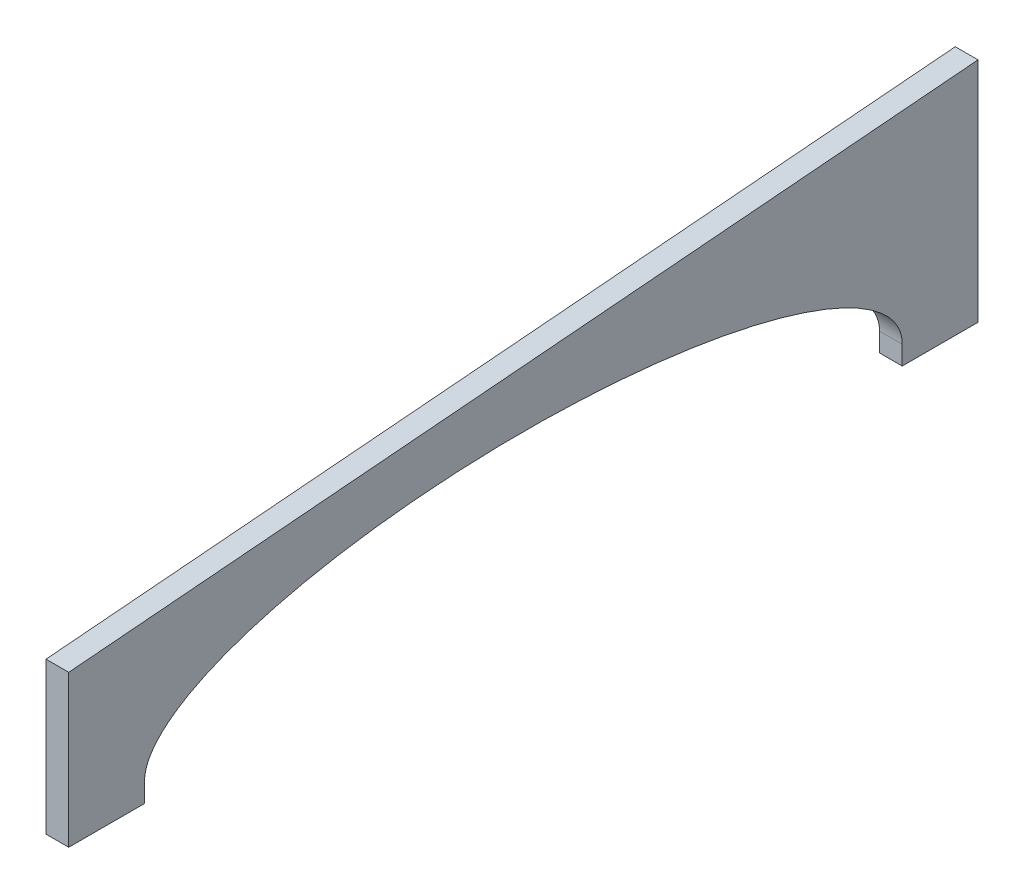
ISO-10303-21;
HEADER;
FILE_DESCRIPTION(('STEP AP214'),'2;1');
FILE_NAME('part.step','',(''),(''),'','','');
FILE_SCHEMA(('AUTOMOTIVE_DESIGN { 1 0 10303 214 1 1 1 1 }'));
ENDSEC;
DATA;
#1=APPLICATION_CONTEXT('core data for automotive mechanical design processes');
#2=APPLICATION_PROTOCOL_DEFINITION('international standard','automotive_design',2000,#1);
#3=PRODUCT_CONTEXT('',#1,'mechanical');
#4=PRODUCT('Part','Part','',(#3));
#5=PRODUCT_RELATED_PRODUCT_CATEGORY('part','',(#4));
#6=PRODUCT_DEFINITION_FORMATION('','',#4);
#7=PRODUCT_DEFINITION_CONTEXT('part definition',#1,'design');
#8=PRODUCT_DEFINITION('design','',#6,#7);
#9=PRODUCT_DEFINITION_SHAPE('','',#8);
#10=(LENGTH_UNIT() NAMED_UNIT(*) SI_UNIT(.MILLI.,.METRE.));
#11=(NAMED_UNIT(*) PLANE_ANGLE_UNIT() SI_UNIT($,.RADIAN.));
#12=(NAMED_UNIT(*) SI_UNIT($,.STERADIAN.) SOLID_ANGLE_UNIT());
#13=UNCERTAINTY_MEASURE_WITH_UNIT(LENGTH_MEASURE(1.E-05),#10,'distance_accuracy_value','');
#14=(GEOMETRIC_REPRESENTATION_CONTEXT(3) GLOBAL_UNCERTAINTY_ASSIGNED_CONTEXT((#13)) GLOBAL_UNIT_ASSIGNED_CONTEXT((#10,
#11,#12)) REPRESENTATION_CONTEXT('',''));
#15=CARTESIAN_POINT('',(0.,0.,0.));
#16=DIRECTION('',(0.,0.,1.));
#17=DIRECTION('',(1.,0.,0.));
#18=AXIS2_PLACEMENT_3D('',#15,#16,#17);
#19=CARTESIAN_POINT('',(6.,40.,0.));
#20=DIRECTION('',(0.,-0.996545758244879,-0.0830454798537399));
#21=DIRECTION('',(0.,0.0830454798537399,-0.99654575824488));
#22=AXIS2_PLACEMENT_3D('',#19,#20,#21);
#23=PLANE('',#22);
#24=DIRECTION('',(0.,-0.0830454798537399,0.99654575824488));
#25=VECTOR('',#24,1.);
#26=CARTESIAN_POINT('',(0.,40.,0.));
#27=LINE('',#26,#25);
#28=CARTESIAN_POINT('',(0.,60.,-240.));
#29=VERTEX_POINT('',#28);
#30=CARTESIAN_POINT('',(0.,40.,0.));
#31=VERTEX_POINT('',#30);
#32=EDGE_CURVE('E129',#29,#31,#27,.T.);
#33=ORIENTED_EDGE('',*,*,#32,.T.);
#34=DIRECTION('',(-1.,0.,0.));
#35=VECTOR('',#34,1.);
#36=CARTESIAN_POINT('',(6.,40.,0.));
#37=LINE('',#36,#35);
#38=CARTESIAN_POINT('',(6.,40.,0.));
#39=VERTEX_POINT('',#38);
#40=EDGE_CURVE('E11',#39,#31,#37,.T.);
#41=ORIENTED_EDGE('',*,*,#40,.F.);
#42=DIRECTION('',(0.,-0.0830454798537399,0.99654575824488));
#43=VECTOR('',#42,1.);
#44=CARTESIAN_POINT('',(6.,40.,0.));
#45=LINE('',#44,#43);
#46=CARTESIAN_POINT('',(6.,60.,-240.));
#47=VERTEX_POINT('',#46);
#48=EDGE_CURVE('E143',#47,#39,#45,.T.);
#49=ORIENTED_EDGE('',*,*,#48,.F.);
#50=DIRECTION('',(-1.,0.,0.));
#51=VECTOR('',#50,1.);
#52=CARTESIAN_POINT('',(6.,60.,-240.));
#53=LINE('',#52,#51);
#54=EDGE_CURVE('E125',#47,#29,#53,.T.);
#55=ORIENTED_EDGE('',*,*,#54,.T.);
#56=EDGE_LOOP('',(#33,#41,#49,#55));
#57=FACE_BOUND('',#56,.T.);
#58=ADVANCED_FACE('F33',(#57),#23,.F.);
#59=CARTESIAN_POINT('',(6.,40.,0.));
#60=DIRECTION('',(0.,0.,-1.));
#61=DIRECTION('',(-1.,0.,0.));
#62=AXIS2_PLACEMENT_3D('',#59,#60,#61);
#63=PLANE('',#62);
#64=DIRECTION('',(0.,-1.,0.));
#65=VECTOR('',#64,1.);
#66=CARTESIAN_POINT('',(0.,40.,0.));
#67=LINE('',#66,#65);
#68=CARTESIAN_POINT('',(0.,0.,0.));
#69=VERTEX_POINT('',#68);
#70=EDGE_CURVE('E132',#31,#69,#67,.T.);
#71=ORIENTED_EDGE('',*,*,#70,.T.);
#72=DIRECTION('',(-1.,0.,0.));
#73=VECTOR('',#72,1.);
#74=CARTESIAN_POINT('',(6.,0.,0.));
#75=LINE('',#74,#73);
#76=CARTESIAN_POINT('',(6.,0.,0.));
#77=VERTEX_POINT('',#76);
#78=EDGE_CURVE('E41',#77,#69,#75,.T.);
#79=ORIENTED_EDGE('',*,*,#78,.F.);
#80=DIRECTION('',(0.,-1.,0.));
#81=VECTOR('',#80,1.);
#82=CARTESIAN_POINT('',(6.,40.,0.));
#83=LINE('',#82,#81);
#84=EDGE_CURVE('E92',#39,#77,#83,.T.);
#85=ORIENTED_EDGE('',*,*,#84,.F.);
#86=ORIENTED_EDGE('',*,*,#40,.T.);
#87=EDGE_LOOP('',(#71,#79,#85,#86));
#88=FACE_BOUND('',#87,.T.);
#89=ADVANCED_FACE('F182',(#88),#63,.F.);
#90=CARTESIAN_POINT('',(6.,0.,0.));
#91=DIRECTION('',(0.,1.,0.));
#92=DIRECTION('',(0.,0.,1.));
#93=AXIS2_PLACEMENT_3D('',#90,#91,#92);
#94=PLANE('',#93);
#95=DIRECTION('',(0.,0.,-1.));
#96=VECTOR('',#95,1.);
#97=CARTESIAN_POINT('',(0.,0.,0.));
#98=LINE('',#97,#96);
#99=CARTESIAN_POINT('',(0.,0.,-20.));
#100=VERTEX_POINT('',#99);
#101=EDGE_CURVE('E134',#69,#100,#98,.T.);
#102=ORIENTED_EDGE('',*,*,#101,.T.);
#103=DIRECTION('',(-1.,0.,0.));
#104=VECTOR('',#103,1.);
#105=CARTESIAN_POINT('',(6.,0.,-20.));
#106=LINE('',#105,#104);
#107=CARTESIAN_POINT('',(6.,0.,-20.));
#108=VERTEX_POINT('',#107);
#109=EDGE_CURVE('E150',#108,#100,#106,.T.);
#110=ORIENTED_EDGE('',*,*,#109,.F.);
#111=DIRECTION('',(0.,0.,-1.));
#112=VECTOR('',#111,1.);
#113=CARTESIAN_POINT('',(6.,0.,0.));
#114=LINE('',#113,#112);
#115=EDGE_CURVE('E158',#77,#108,#114,.T.);
#116=ORIENTED_EDGE('',*,*,#115,.F.);
#117=ORIENTED_EDGE('',*,*,#78,.T.);
#118=EDGE_LOOP('',(#102,#110,#116,#117));
#119=FACE_BOUND('',#118,.T.);
#120=ADVANCED_FACE('F156',(#119),#94,.F.);
#121=CARTESIAN_POINT('',(6.,0.,-20.));
#122=DIRECTION('',(0.,0.,1.));
#123=DIRECTION('',(1.,0.,0.));
#124=AXIS2_PLACEMENT_3D('',#121,#122,#123);
#125=PLANE('',#124);
#126=DIRECTION('',(0.,1.,0.));
#127=VECTOR('',#126,1.);
#128=CARTESIAN_POINT('',(0.,0.,-20.));
#129=LINE('',#128,#127);
#130=CARTESIAN_POINT('',(0.,4.99999999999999,-20.));
#131=VERTEX_POINT('',#130);
#132=EDGE_CURVE('E136',#100,#131,#129,.T.);
#133=ORIENTED_EDGE('',*,*,#132,.T.);
#134=DIRECTION('',(-1.,0.,0.));
#135=VECTOR('',#134,1.);
#136=CARTESIAN_POINT('',(6.,4.99999999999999,-20.));
#137=LINE('',#136,#135);
#138=CARTESIAN_POINT('',(6.,4.99999999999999,-20.));
#139=VERTEX_POINT('',#138);
#140=EDGE_CURVE('E147',#139,#131,#137,.T.);
#141=ORIENTED_EDGE('',*,*,#140,.F.);
#142=DIRECTION('',(0.,1.,0.));
#143=VECTOR('',#142,1.);
#144=CARTESIAN_POINT('',(6.,0.,-20.));
#145=LINE('',#144,#143);
#146=EDGE_CURVE('E170',#108,#139,#145,.T.);
#147=ORIENTED_EDGE('',*,*,#146,.F.);
#148=ORIENTED_EDGE('',*,*,#109,.T.);
#149=EDGE_LOOP('',(#133,#141,#147,#148));
#150=FACE_BOUND('',#149,.T.);
#151=ADVANCED_FACE('F166',(#150),#125,.F.);
#152=CARTESIAN_POINT('',(6.,5.,-120.));
#153=DIRECTION('',(-1.,0.,0.));
#154=DIRECTION('',(0.,0.,1.));
#155=AXIS2_PLACEMENT_3D('',#152,#153,#154);
#156=ELLIPSE('',#155,100.,30.);
#157=DIRECTION('',(-1.,0.,0.));
#158=VECTOR('',#157,1.);
#159=SURFACE_OF_LINEAR_EXTRUSION('',#156,#158);
#160=CARTESIAN_POINT('',(0.,5.,-120.));
#161=DIRECTION('',(-1.,0.,0.));
#162=DIRECTION('',(0.,0.,1.));
#163=AXIS2_PLACEMENT_3D('',#160,#161,#162);
#164=ELLIPSE('',#163,100.,30.);
#165=CARTESIAN_POINT('',(0.,4.99999999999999,-220.));
#166=VERTEX_POINT('',#165);
#167=EDGE_CURVE('E138',#131,#166,#164,.T.);
#168=ORIENTED_EDGE('',*,*,#167,.T.);
#169=DIRECTION('',(-1.,0.,0.));
#170=VECTOR('',#169,1.);
#171=CARTESIAN_POINT('',(6.,4.99999999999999,-220.));
#172=LINE('',#171,#170);
#173=CARTESIAN_POINT('',(6.,4.99999999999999,-220.));
#174=VERTEX_POINT('',#173);
#175=EDGE_CURVE('E120',#174,#166,#172,.T.);
#176=ORIENTED_EDGE('',*,*,#175,.F.);
#177=EDGE_CURVE('E111',#139,#174,#156,.T.);
#178=ORIENTED_EDGE('',*,*,#177,.F.);
#179=ORIENTED_EDGE('',*,*,#140,.T.);
#180=EDGE_LOOP('',(#168,#176,#178,#179));
#181=FACE_BOUND('',#180,.T.);
#182=ADVANCED_FACE('F169',(#181),#159,.F.);
#183=CARTESIAN_POINT('',(6.,0.,-220.));
#184=DIRECTION('',(0.,0.,-1.));
#185=DIRECTION('',(-1.,0.,0.));
#186=AXIS2_PLACEMENT_3D('',#183,#184,#185);
#187=PLANE('',#186);
#188=DIRECTION('',(0.,-1.,0.));
#189=VECTOR('',#188,1.);
#190=CARTESIAN_POINT('',(0.,0.,-220.));
#191=LINE('',#190,#189);
#192=CARTESIAN_POINT('',(0.,0.,-220.));
#193=VERTEX_POINT('',#192);
#194=EDGE_CURVE('E119',#166,#193,#191,.T.);
#195=ORIENTED_EDGE('',*,*,#194,.T.);
#196=DIRECTION('',(-1.,0.,0.));
#197=VECTOR('',#196,1.);
#198=CARTESIAN_POINT('',(6.,0.,-220.));
#199=LINE('',#198,#197);
#200=CARTESIAN_POINT('',(6.,0.,-220.));
#201=VERTEX_POINT('',#200);
#202=EDGE_CURVE('E116',#201,#193,#199,.T.);
#203=ORIENTED_EDGE('',*,*,#202,.F.);
#204=DIRECTION('',(0.,-1.,0.));
#205=VECTOR('',#204,1.);
#206=CARTESIAN_POINT('',(6.,0.,-220.));
#207=LINE('',#206,#205);
#208=EDGE_CURVE('E105',#174,#201,#207,.T.);
#209=ORIENTED_EDGE('',*,*,#208,.F.);
#210=ORIENTED_EDGE('',*,*,#175,.T.);
#211=EDGE_LOOP('',(#195,#203,#209,#210));
#212=FACE_BOUND('',#211,.T.);
#213=ADVANCED_FACE('F117',(#212),#187,.F.);
#214=CARTESIAN_POINT('',(6.,0.,-220.));
#215=DIRECTION('',(0.,1.,0.));
#216=DIRECTION('',(0.,0.,1.));
#217=AXIS2_PLACEMENT_3D('',#214,#215,#216);
#218=PLANE('',#217);
#219=DIRECTION('',(0.,0.,-1.));
#220=VECTOR('',#219,1.);
#221=CARTESIAN_POINT('',(0.,0.,-220.));
#222=LINE('',#221,#220);
#223=CARTESIAN_POINT('',(0.,0.,-240.));
#224=VERTEX_POINT('',#223);
#225=EDGE_CURVE('E78',#193,#224,#222,.T.);
#226=ORIENTED_EDGE('',*,*,#225,.T.);
#227=DIRECTION('',(-1.,0.,0.));
#228=VECTOR('',#227,1.);
#229=CARTESIAN_POINT('',(6.,0.,-240.));
#230=LINE('',#229,#228);
#231=CARTESIAN_POINT('',(6.,0.,-240.));
#232=VERTEX_POINT('',#231);
#233=EDGE_CURVE('E121',#232,#224,#230,.T.);
#234=ORIENTED_EDGE('',*,*,#233,.F.);
#235=DIRECTION('',(0.,0.,-1.));
#236=VECTOR('',#235,1.);
#237=CARTESIAN_POINT('',(6.,0.,-220.));
#238=LINE('',#237,#236);
#239=EDGE_CURVE('E109',#201,#232,#238,.T.);
#240=ORIENTED_EDGE('',*,*,#239,.F.);
#241=ORIENTED_EDGE('',*,*,#202,.T.);
#242=EDGE_LOOP('',(#226,#234,#240,#241));
#243=FACE_BOUND('',#242,.T.);
#244=ADVANCED_FACE('F123',(#243),#218,.F.);
#245=CARTESIAN_POINT('',(6.,0.,-240.));
#246=DIRECTION('',(0.,0.,1.));
#247=DIRECTION('',(1.,0.,0.));
#248=AXIS2_PLACEMENT_3D('',#245,#246,#247);
#249=PLANE('',#248);
#250=DIRECTION('',(0.,1.,0.));
#251=VECTOR('',#250,1.);
#252=CARTESIAN_POINT('',(0.,0.,-240.));
#253=LINE('',#252,#251);
#254=EDGE_CURVE('E84',#224,#29,#253,.T.);
#255=ORIENTED_EDGE('',*,*,#254,.T.);
#256=ORIENTED_EDGE('',*,*,#54,.F.);
#257=DIRECTION('',(0.,1.,0.));
#258=VECTOR('',#257,1.);
#259=CARTESIAN_POINT('',(6.,0.,-240.));
#260=LINE('',#259,#258);
#261=EDGE_CURVE('E49',#232,#47,#260,.T.);
#262=ORIENTED_EDGE('',*,*,#261,.F.);
#263=ORIENTED_EDGE('',*,*,#233,.T.);
#264=EDGE_LOOP('',(#255,#256,#262,#263));
#265=FACE_BOUND('',#264,.T.);
#266=ADVANCED_FACE('F190',(#265),#249,.F.);
#267=CARTESIAN_POINT('',(6.,5.,-120.));
#268=DIRECTION('',(1.,0.,0.));
#269=DIRECTION('',(0.,0.,-1.));
#270=AXIS2_PLACEMENT_3D('',#267,#268,#269);
#271=PLANE('',#270);
#272=ORIENTED_EDGE('',*,*,#48,.T.);
#273=ORIENTED_EDGE('',*,*,#84,.T.);
#274=ORIENTED_EDGE('',*,*,#115,.T.);
#275=ORIENTED_EDGE('',*,*,#146,.T.);
#276=ORIENTED_EDGE('',*,*,#177,.T.);
#277=ORIENTED_EDGE('',*,*,#208,.T.);
#278=ORIENTED_EDGE('',*,*,#239,.T.);
#279=ORIENTED_EDGE('',*,*,#261,.T.);
#280=EDGE_LOOP('',(#272,#273,#274,#275,#276,#277,#278,#279));
#281=FACE_BOUND('',#280,.T.);
#282=ADVANCED_FACE('F107',(#281),#271,.T.);
#283=CARTESIAN_POINT('',(0.,5.,-120.));
#284=DIRECTION('',(1.,0.,0.));
#285=DIRECTION('',(0.,0.,-1.));
#286=AXIS2_PLACEMENT_3D('',#283,#284,#285);
#287=PLANE('',#286);
#288=ORIENTED_EDGE('',*,*,#32,.F.);
#289=ORIENTED_EDGE('',*,*,#254,.F.);
#290=ORIENTED_EDGE('',*,*,#225,.F.);
#291=ORIENTED_EDGE('',*,*,#194,.F.);
#292=ORIENTED_EDGE('',*,*,#167,.F.);
#293=ORIENTED_EDGE('',*,*,#132,.F.);
#294=ORIENTED_EDGE('',*,*,#101,.F.);
#295=ORIENTED_EDGE('',*,*,#70,.F.);
#296=EDGE_LOOP('',(#288,#289,#290,#291,#292,#293,#294,#295));
#297=FACE_BOUND('',#296,.T.);
#298=ADVANCED_FACE('F162',(#297),#287,.F.);
#299=CLOSED_SHELL('',(#58,#89,#120,#151,#182,#213,#244,#266,#282,#298));
#300=MANIFOLD_SOLID_BREP('B2',#299);
#301=ADVANCED_BREP_SHAPE_REPRESENTATION('',(#18,#300),#14);
#302=SHAPE_DEFINITION_REPRESENTATION(#9,#301);
ENDSEC;
END-ISO-10303-21;
